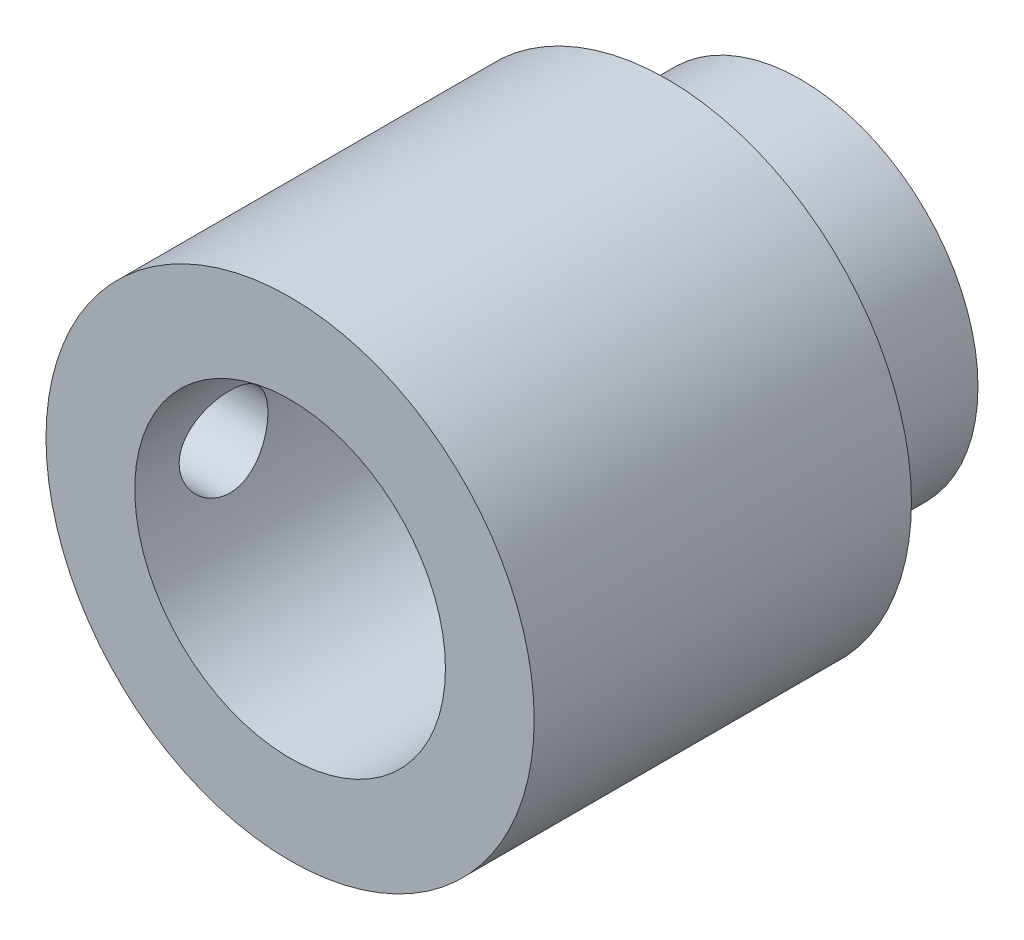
ISO-10303-21;
HEADER;
FILE_DESCRIPTION(('STEP AP214'),'2;1');
FILE_NAME('part.step','',(''),(''),'','','');
FILE_SCHEMA(('AUTOMOTIVE_DESIGN { 1 0 10303 214 1 1 1 1 }'));
ENDSEC;
DATA;
#1=APPLICATION_CONTEXT('core data for automotive mechanical design processes');
#2=APPLICATION_PROTOCOL_DEFINITION('international standard','automotive_design',2000,#1);
#3=PRODUCT_CONTEXT('',#1,'mechanical');
#4=PRODUCT('Part','Part','',(#3));
#5=PRODUCT_RELATED_PRODUCT_CATEGORY('part','',(#4));
#6=PRODUCT_DEFINITION_FORMATION('','',#4);
#7=PRODUCT_DEFINITION_CONTEXT('part definition',#1,'design');
#8=PRODUCT_DEFINITION('design','',#6,#7);
#9=PRODUCT_DEFINITION_SHAPE('','',#8);
#10=(LENGTH_UNIT() NAMED_UNIT(*) SI_UNIT(.MILLI.,.METRE.));
#11=(NAMED_UNIT(*) PLANE_ANGLE_UNIT() SI_UNIT($,.RADIAN.));
#12=(NAMED_UNIT(*) SI_UNIT($,.STERADIAN.) SOLID_ANGLE_UNIT());
#13=UNCERTAINTY_MEASURE_WITH_UNIT(LENGTH_MEASURE(1.E-05),#10,'distance_accuracy_value','');
#14=(GEOMETRIC_REPRESENTATION_CONTEXT(3) GLOBAL_UNCERTAINTY_ASSIGNED_CONTEXT((#13)) GLOBAL_UNIT_ASSIGNED_CONTEXT((#10,
#11,#12)) REPRESENTATION_CONTEXT('',''));
#15=CARTESIAN_POINT('',(0.,0.,0.));
#16=DIRECTION('',(0.,0.,1.));
#17=DIRECTION('',(1.,0.,0.));
#18=AXIS2_PLACEMENT_3D('',#15,#16,#17);
#19=CARTESIAN_POINT('',(0.,0.,0.));
#20=DIRECTION('',(0.,0.,1.));
#21=DIRECTION('',(1.,0.,0.));
#22=AXIS2_PLACEMENT_3D('',#19,#20,#21);
#23=PLANE('',#22);
#24=CARTESIAN_POINT('',(0.,0.,0.));
#25=DIRECTION('',(0.,0.,1.));
#26=DIRECTION('',(1.,0.,0.));
#27=AXIS2_PLACEMENT_3D('',#24,#25,#26);
#28=CIRCLE('',#27,5.5);
#29=CARTESIAN_POINT('',(5.5,0.,0.));
#30=VERTEX_POINT('',#29);
#31=EDGE_CURVE('E44',#30,#30,#28,.T.);
#32=ORIENTED_EDGE('',*,*,#31,.F.);
#33=EDGE_LOOP('',(#32));
#34=FACE_BOUND('',#33,.T.);
#35=CARTESIAN_POINT('',(0.,0.,0.));
#36=DIRECTION('',(0.,0.,1.));
#37=DIRECTION('',(1.,0.,0.));
#38=AXIS2_PLACEMENT_3D('',#35,#36,#37);
#39=CIRCLE('',#38,4.);
#40=CARTESIAN_POINT('',(4.,0.,0.));
#41=VERTEX_POINT('',#40);
#42=EDGE_CURVE('E10',#41,#41,#39,.F.);
#43=ORIENTED_EDGE('',*,*,#42,.F.);
#44=EDGE_LOOP('',(#43));
#45=FACE_BOUND('',#44,.T.);
#46=ADVANCED_FACE('F27',(#34,#45),#23,.F.);
#47=CARTESIAN_POINT('',(0.,0.,8.5));
#48=DIRECTION('',(0.,0.,-1.));
#49=DIRECTION('',(-1.,0.,0.));
#50=AXIS2_PLACEMENT_3D('',#47,#48,#49);
#51=CYLINDRICAL_SURFACE('',#50,5.5);
#52=CARTESIAN_POINT('',(-5.5,0.,5.5));
#53=CARTESIAN_POINT('',(-5.49999900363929,0.0556786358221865,5.50000215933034));
#54=CARTESIAN_POINT('',(-5.49914576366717,0.111385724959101,5.50466587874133));
#55=CARTESIAN_POINT('',(-5.49582423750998,0.221232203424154,5.52318673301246));
#56=CARTESIAN_POINT('',(-5.4933545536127,0.275370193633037,5.53705182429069));
#57=CARTESIAN_POINT('',(-5.48707661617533,0.380473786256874,5.57353856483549));
#58=CARTESIAN_POINT('',(-5.4832695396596,0.431442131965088,5.59615251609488));
#59=CARTESIAN_POINT('',(-5.47473335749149,0.528856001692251,5.64947366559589));
#60=CARTESIAN_POINT('',(-5.47000433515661,0.575301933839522,5.6801801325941));
#61=CARTESIAN_POINT('',(-5.46008716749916,0.662882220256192,5.74918295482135));
#62=CARTESIAN_POINT('',(-5.45489486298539,0.703958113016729,5.78755292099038));
#63=CARTESIAN_POINT('',(-5.44466747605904,0.779126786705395,5.87063517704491));
#64=CARTESIAN_POINT('',(-5.43963240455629,0.813219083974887,5.91534790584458));
#65=CARTESIAN_POINT('',(-5.43024920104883,0.873693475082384,6.01025636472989));
#66=CARTESIAN_POINT('',(-5.42590643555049,0.900016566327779,6.06049026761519));
#67=CARTESIAN_POINT('',(-5.41845791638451,0.943827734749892,6.16475932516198));
#68=CARTESIAN_POINT('',(-5.41535206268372,0.961316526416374,6.21879417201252));
#69=CARTESIAN_POINT('',(-5.41077076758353,0.986775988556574,6.3285073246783));
#70=CARTESIAN_POINT('',(-5.40927792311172,0.994848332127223,6.38416129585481));
#71=CARTESIAN_POINT('',(-5.40803915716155,1.00156124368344,6.49605220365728));
#72=CARTESIAN_POINT('',(-5.40829308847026,1.00020260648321,6.55228909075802));
#73=CARTESIAN_POINT('',(-5.4105033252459,0.988174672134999,6.66301595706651));
#74=CARTESIAN_POINT('',(-5.41243856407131,0.97762058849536,6.71751893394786));
#75=CARTESIAN_POINT('',(-5.41776030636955,0.947682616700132,6.82396750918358));
#76=CARTESIAN_POINT('',(-5.42114686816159,0.928298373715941,6.87591300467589));
#77=CARTESIAN_POINT('',(-5.42901190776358,0.881136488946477,6.97611139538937));
#78=CARTESIAN_POINT('',(-5.43349645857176,0.853311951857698,7.02434172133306));
#79=CARTESIAN_POINT('',(-5.44304811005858,0.790092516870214,7.11549236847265));
#80=CARTESIAN_POINT('',(-5.44811526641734,0.754696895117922,7.15841218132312));
#81=CARTESIAN_POINT('',(-5.45835320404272,0.676716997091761,7.23838949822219));
#82=CARTESIAN_POINT('',(-5.46352440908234,0.634034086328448,7.27535084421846));
#83=CARTESIAN_POINT('',(-5.47331875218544,0.543022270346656,7.34160256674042));
#84=CARTESIAN_POINT('',(-5.4779418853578,0.494693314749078,7.37089287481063));
#85=CARTESIAN_POINT('',(-5.4861276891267,0.393663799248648,7.42098369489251));
#86=CARTESIAN_POINT('',(-5.48968916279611,0.340958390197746,7.44177463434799));
#87=CARTESIAN_POINT('',(-5.49534102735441,0.232724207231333,7.47418159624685));
#88=CARTESIAN_POINT('',(-5.49743156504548,0.177195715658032,7.48579853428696));
#89=CARTESIAN_POINT('',(-5.49988596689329,0.0657193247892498,7.49939488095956));
#90=CARTESIAN_POINT('',(-5.50027344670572,0.00978800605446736,7.50150611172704));
#91=CARTESIAN_POINT('',(-5.4993431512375,-0.101628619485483,7.49638410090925));
#92=CARTESIAN_POINT('',(-5.49802545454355,-0.157113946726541,7.48915128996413));
#93=CARTESIAN_POINT('',(-5.49384754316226,-0.265648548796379,7.46565612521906));
#94=CARTESIAN_POINT('',(-5.49099865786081,-0.318712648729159,7.44946006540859));
#95=CARTESIAN_POINT('',(-5.48407647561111,-0.421372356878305,7.40856958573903));
#96=CARTESIAN_POINT('',(-5.48000309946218,-0.470967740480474,7.38387461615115));
#97=CARTESIAN_POINT('',(-5.4710248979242,-0.565847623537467,7.32639268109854));
#98=CARTESIAN_POINT('',(-5.466111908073,-0.61108222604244,7.29352465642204));
#99=CARTESIAN_POINT('',(-5.45602144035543,-0.695441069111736,7.22073981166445));
#100=CARTESIAN_POINT('',(-5.45084393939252,-0.734564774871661,7.18082237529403));
#101=CARTESIAN_POINT('',(-5.44073019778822,-0.806088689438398,7.09447655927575));
#102=CARTESIAN_POINT('',(-5.43579776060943,-0.838399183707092,7.04797334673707));
#103=CARTESIAN_POINT('',(-5.4268075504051,-0.894749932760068,6.95012190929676));
#104=CARTESIAN_POINT('',(-5.42274974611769,-0.918790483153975,6.89877385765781));
#105=CARTESIAN_POINT('',(-5.41599772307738,-0.957789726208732,6.79292462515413));
#106=CARTESIAN_POINT('',(-5.41329719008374,-0.972790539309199,6.73843938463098));
#107=CARTESIAN_POINT('',(-5.40955063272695,-0.993415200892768,6.62766850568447));
#108=CARTESIAN_POINT('',(-5.40850443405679,-0.999040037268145,6.57138305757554));
#109=CARTESIAN_POINT('',(-5.40819346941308,-1.00072156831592,6.45950731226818));
#110=CARTESIAN_POINT('',(-5.40890237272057,-0.996919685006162,6.40391916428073));
#111=CARTESIAN_POINT('',(-5.41196354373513,-0.980164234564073,6.29418818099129));
#112=CARTESIAN_POINT('',(-5.41431580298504,-0.967210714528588,6.24004533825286));
#113=CARTESIAN_POINT('',(-5.42038786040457,-0.932577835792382,6.13481190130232));
#114=CARTESIAN_POINT('',(-5.42410539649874,-0.91091290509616,6.08371641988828));
#115=CARTESIAN_POINT('',(-5.43249088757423,-0.859487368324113,5.98586277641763));
#116=CARTESIAN_POINT('',(-5.4371589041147,-0.829726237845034,5.93910489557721));
#117=CARTESIAN_POINT('',(-5.44700162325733,-0.762457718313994,5.85054356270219));
#118=CARTESIAN_POINT('',(-5.45218253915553,-0.724847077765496,5.80881921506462));
#119=CARTESIAN_POINT('',(-5.46241996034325,-0.643163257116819,5.7322264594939));
#120=CARTESIAN_POINT('',(-5.46747643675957,-0.599088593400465,5.69735962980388));
#121=CARTESIAN_POINT('',(-5.47694487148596,-0.505285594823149,5.63519985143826));
#122=CARTESIAN_POINT('',(-5.48135106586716,-0.455512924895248,5.60797290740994));
#123=CARTESIAN_POINT('',(-5.48896630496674,-0.352036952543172,5.56231039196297));
#124=CARTESIAN_POINT('',(-5.49217649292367,-0.298337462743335,5.54386642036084));
#125=CARTESIAN_POINT('',(-5.49637035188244,-0.203720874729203,5.52011228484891));
#126=CARTESIAN_POINT('',(-5.49772390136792,-0.163362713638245,5.51258283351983));
#127=CARTESIAN_POINT('',(-5.49953908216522,-0.0820081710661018,5.50252595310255));
#128=CARTESIAN_POINT('',(-5.50000073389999,-0.0410118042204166,5.49999840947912));
#129=CARTESIAN_POINT('',(-5.5,0.,5.5));
#130=B_SPLINE_CURVE_WITH_KNOTS('',3,(#52,#53,#54,#55,#56,#57,#58,#59,#60,#61,#62,#63,#64,#65,
#66,#67,#68,#69,#70,#71,#72,#73,#74,#75,#76,#77,#78,#79,#80,#81,#82,#83,#84,#85,#86,#87,#88,#89,
#90,#91,#92,#93,#94,#95,#96,#97,#98,#99,#100,#101,#102,#103,#104,#105,#106,#107,#108,#109,#110,
#111,#112,#113,#114,#115,#116,#117,#118,#119,#120,#121,#122,#123,#124,#125,#126,#127,#128,#129),
.UNSPECIFIED.,.T.,.F.,(4,2,2,2,2,2,2,2,2,2,2,2,2,2,2,2,2,2,2,2,2,2,2,2,2,2,2,2,2,2,2,2,2,2,2,2,
2,2,4),(0.,0.166885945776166,0.333916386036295,0.500800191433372,0.667668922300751,
0.836225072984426,1.00479289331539,1.17460976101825,1.34441289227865,1.51236510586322,
1.68030316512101,1.84616683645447,2.01203717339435,2.17884653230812,2.34567184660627,
2.51496605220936,2.68426176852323,2.85374763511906,3.02321658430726,3.19032800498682,
3.35743172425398,3.52331571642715,3.6892104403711,3.85682113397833,4.02444648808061,
4.19415753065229,4.36386250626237,4.53277050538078,4.70166070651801,4.86803254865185,
5.03440353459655,5.20050010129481,5.36660742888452,5.53505557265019,5.70354243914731,
5.87344302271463,6.04318078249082,6.16610855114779,6.28903350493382),.UNSPECIFIED.);
#131=CARTESIAN_POINT('',(-5.5,0.,5.5));
#132=VERTEX_POINT('',#131);
#133=EDGE_CURVE('E70',#132,#132,#130,.T.);
#134=ORIENTED_EDGE('',*,*,#133,.T.);
#135=EDGE_LOOP('',(#134));
#136=FACE_BOUND('',#135,.T.);
#137=CARTESIAN_POINT('',(0.,0.,8.5));
#138=DIRECTION('',(0.,0.,1.));
#139=DIRECTION('',(1.,0.,0.));
#140=AXIS2_PLACEMENT_3D('',#137,#138,#139);
#141=CIRCLE('',#140,5.5);
#142=CARTESIAN_POINT('',(5.5,0.,8.5));
#143=VERTEX_POINT('',#142);
#144=EDGE_CURVE('E40',#143,#143,#141,.T.);
#145=ORIENTED_EDGE('',*,*,#144,.F.);
#146=EDGE_LOOP('',(#145));
#147=FACE_BOUND('',#146,.T.);
#148=ORIENTED_EDGE('',*,*,#31,.T.);
#149=EDGE_LOOP('',(#148));
#150=FACE_BOUND('',#149,.T.);
#151=ADVANCED_FACE('F29',(#136,#147,#150),#51,.T.);
#152=CARTESIAN_POINT('',(0.,0.,8.5));
#153=DIRECTION('',(0.,0.,1.));
#154=DIRECTION('',(1.,0.,0.));
#155=AXIS2_PLACEMENT_3D('',#152,#153,#154);
#156=PLANE('',#155);
#157=CARTESIAN_POINT('',(0.,0.,8.5));
#158=DIRECTION('',(0.,0.,1.));
#159=DIRECTION('',(1.,0.,0.));
#160=AXIS2_PLACEMENT_3D('',#157,#158,#159);
#161=CIRCLE('',#160,3.5);
#162=CARTESIAN_POINT('',(3.5,0.,8.5));
#163=VERTEX_POINT('',#162);
#164=EDGE_CURVE('E49',#163,#163,#161,.T.);
#165=ORIENTED_EDGE('',*,*,#164,.F.);
#166=EDGE_LOOP('',(#165));
#167=FACE_BOUND('',#166,.T.);
#168=ORIENTED_EDGE('',*,*,#144,.T.);
#169=EDGE_LOOP('',(#168));
#170=FACE_BOUND('',#169,.T.);
#171=ADVANCED_FACE('F107',(#167,#170),#156,.T.);
#172=CARTESIAN_POINT('',(0.,0.,8.5));
#173=DIRECTION('',(0.,0.,1.));
#174=DIRECTION('',(1.,0.,0.));
#175=AXIS2_PLACEMENT_3D('',#172,#173,#174);
#176=CYLINDRICAL_SURFACE('',#175,3.5);
#177=CARTESIAN_POINT('',(-3.5,0.,5.5));
#178=CARTESIAN_POINT('',(-3.49999934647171,-0.0549774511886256,5.50000096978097));
#179=CARTESIAN_POINT('',(-3.49869208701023,-0.109964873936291,5.50454889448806));
#180=CARTESIAN_POINT('',(-3.49360452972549,-0.218345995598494,5.52258213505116));
#181=CARTESIAN_POINT('',(-3.48982329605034,-0.271739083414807,5.53607083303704));
#182=CARTESIAN_POINT('',(-3.48020345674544,-0.375352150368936,5.57150401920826));
#183=CARTESIAN_POINT('',(-3.474367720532,-0.425576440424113,5.59343671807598));
#184=CARTESIAN_POINT('',(-3.46124989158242,-0.521634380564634,5.64508899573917));
#185=CARTESIAN_POINT('',(-3.45396764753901,-0.567467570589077,5.67480938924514));
#186=CARTESIAN_POINT('',(-3.43852367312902,-0.654647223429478,5.7420175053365));
#187=CARTESIAN_POINT('',(-3.4303452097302,-0.69586186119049,5.77967237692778));
#188=CARTESIAN_POINT('',(-3.41413367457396,-0.771485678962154,5.8613238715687));
#189=CARTESIAN_POINT('',(-3.40610062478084,-0.805893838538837,5.90532144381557));
#190=CARTESIAN_POINT('',(-3.39091507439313,-0.867598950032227,5.99949679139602));
#191=CARTESIAN_POINT('',(-3.38378351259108,-0.894739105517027,6.04978099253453));
#192=CARTESIAN_POINT('',(-3.37145671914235,-0.940125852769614,6.15443600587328));
#193=CARTESIAN_POINT('',(-3.36626107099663,-0.958374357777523,6.2088059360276));
#194=CARTESIAN_POINT('',(-3.35856804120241,-0.984992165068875,6.31861738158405));
#195=CARTESIAN_POINT('',(-3.35600489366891,-0.993602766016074,6.37399568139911));
#196=CARTESIAN_POINT('',(-3.35367104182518,-1.00145333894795,6.48546557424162));
#197=CARTESIAN_POINT('',(-3.35389973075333,-1.00069534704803,6.54155700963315));
#198=CARTESIAN_POINT('',(-3.35706517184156,-0.990020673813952,6.6509343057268));
#199=CARTESIAN_POINT('',(-3.35991391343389,-0.980401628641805,6.70425217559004));
#200=CARTESIAN_POINT('',(-3.36785674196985,-0.952756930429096,6.80848360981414));
#201=CARTESIAN_POINT('',(-3.37295103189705,-0.934730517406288,6.85939695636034));
#202=CARTESIAN_POINT('',(-3.38488431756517,-0.890553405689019,6.95812312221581));
#203=CARTESIAN_POINT('',(-3.39174458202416,-0.864302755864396,7.00588853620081));
#204=CARTESIAN_POINT('',(-3.40642608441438,-0.804491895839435,7.09643828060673));
#205=CARTESIAN_POINT('',(-3.41424753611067,-0.770930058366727,7.13922149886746));
#206=CARTESIAN_POINT('',(-3.43033125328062,-0.695951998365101,7.22028618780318));
#207=CARTESIAN_POINT('',(-3.43859902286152,-0.654287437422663,7.25833723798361));
#208=CARTESIAN_POINT('',(-3.45438123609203,-0.565066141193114,7.32696300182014));
#209=CARTESIAN_POINT('',(-3.46189564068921,-0.517509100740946,7.35753732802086));
#210=CARTESIAN_POINT('',(-3.47538264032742,-0.417461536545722,7.41046436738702));
#211=CARTESIAN_POINT('',(-3.48134637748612,-0.364944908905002,7.43277014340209));
#212=CARTESIAN_POINT('',(-3.49099625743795,-0.256696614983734,7.46816694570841));
#213=CARTESIAN_POINT('',(-3.49468297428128,-0.200965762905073,7.48126029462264));
#214=CARTESIAN_POINT('',(-3.49927437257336,-0.0898331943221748,7.49748664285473));
#215=CARTESIAN_POINT('',(-3.50026636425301,-0.0344806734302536,7.50093234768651));
#216=CARTESIAN_POINT('',(-3.49961042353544,0.0760132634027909,7.49863636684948));
#217=CARTESIAN_POINT('',(-3.49796280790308,0.131154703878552,7.49289578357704));
#218=CARTESIAN_POINT('',(-3.49226963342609,0.238509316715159,7.47264477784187));
#219=CARTESIAN_POINT('',(-3.48827306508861,0.290759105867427,7.45831340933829));
#220=CARTESIAN_POINT('',(-3.47833999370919,0.392104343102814,7.42149974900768));
#221=CARTESIAN_POINT('',(-3.47240326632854,0.441199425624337,7.39901651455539));
#222=CARTESIAN_POINT('',(-3.45904980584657,0.536020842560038,7.34598833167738));
#223=CARTESIAN_POINT('',(-3.45160381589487,0.581651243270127,7.31527940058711));
#224=CARTESIAN_POINT('',(-3.43608973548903,0.667219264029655,7.24687374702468));
#225=CARTESIAN_POINT('',(-3.42802150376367,0.707155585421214,7.20917543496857));
#226=CARTESIAN_POINT('',(-3.41184309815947,0.781553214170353,7.1263953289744));
#227=CARTESIAN_POINT('',(-3.40374018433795,0.81579271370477,7.08111236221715));
#228=CARTESIAN_POINT('',(-3.38869447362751,0.87619765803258,6.98526870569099));
#229=CARTESIAN_POINT('',(-3.3817516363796,0.902363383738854,6.93470819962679));
#230=CARTESIAN_POINT('',(-3.36989325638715,0.945687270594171,6.82995439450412));
#231=CARTESIAN_POINT('',(-3.36496700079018,0.962893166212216,6.77578211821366));
#232=CARTESIAN_POINT('',(-3.35771228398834,0.987897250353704,6.66514503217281));
#233=CARTESIAN_POINT('',(-3.35538303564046,0.995698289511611,6.608680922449));
#234=CARTESIAN_POINT('',(-3.35365851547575,1.00149012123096,6.49735198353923));
#235=CARTESIAN_POINT('',(-3.35415580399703,0.999840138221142,6.44250724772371));
#236=CARTESIAN_POINT('',(-3.35777298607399,0.987623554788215,6.33391263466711));
#237=CARTESIAN_POINT('',(-3.36089279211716,0.977057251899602,6.2801627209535));
#238=CARTESIAN_POINT('',(-3.36933488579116,0.947529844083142,6.17581081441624));
#239=CARTESIAN_POINT('',(-3.37463438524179,0.928655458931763,6.12518230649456));
#240=CARTESIAN_POINT('',(-3.38683651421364,0.883114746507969,6.02777063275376));
#241=CARTESIAN_POINT('',(-3.39373942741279,0.856447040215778,5.98098814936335));
#242=CARTESIAN_POINT('',(-3.40865834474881,0.795032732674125,5.89090823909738));
#243=CARTESIAN_POINT('',(-3.41670381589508,0.760046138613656,5.84777930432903));
#244=CARTESIAN_POINT('',(-3.43284922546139,0.683429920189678,5.76788805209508));
#245=CARTESIAN_POINT('',(-3.4409491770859,0.64179862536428,5.7311273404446));
#246=CARTESIAN_POINT('',(-3.45653979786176,0.551787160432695,5.66408140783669));
#247=CARTESIAN_POINT('',(-3.46400950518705,0.50326125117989,5.63398650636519));
#248=CARTESIAN_POINT('',(-3.47725697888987,0.401625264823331,5.582427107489));
#249=CARTESIAN_POINT('',(-3.48303566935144,0.34851771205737,5.56095789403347));
#250=CARTESIAN_POINT('',(-3.49163672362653,0.246458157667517,5.52957622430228));
#251=CARTESIAN_POINT('',(-3.49474842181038,0.197881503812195,5.51851323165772));
#252=CARTESIAN_POINT('',(-3.49893021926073,0.0995391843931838,5.50372517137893));
#253=CARTESIAN_POINT('',(-3.50000059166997,0.049773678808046,5.49999912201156));
#254=CARTESIAN_POINT('',(-3.5,0.,5.5));
#255=B_SPLINE_CURVE_WITH_KNOTS('',3,(#177,#178,#179,#180,#181,#182,#183,#184,#185,#186,#187,
#188,#189,#190,#191,#192,#193,#194,#195,#196,#197,#198,#199,#200,#201,#202,#203,#204,#205,#206,
#207,#208,#209,#210,#211,#212,#213,#214,#215,#216,#217,#218,#219,#220,#221,#222,#223,#224,#225,
#226,#227,#228,#229,#230,#231,#232,#233,#234,#235,#236,#237,#238,#239,#240,#241,#242,#243,#244,
#245,#246,#247,#248,#249,#250,#251,#252,#253,#254),.UNSPECIFIED.,.T.,.F.,(4,2,2,2,2,2,2,2,2,2,2,
2,2,2,2,2,2,2,2,2,2,2,2,2,2,2,2,2,2,2,2,2,2,2,2,2,2,2,4),(0.,0.164749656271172,0.32956166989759,
0.494144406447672,0.658744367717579,0.827239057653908,0.995758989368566,1.16766537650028,
1.33953475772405,1.50699754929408,1.67442394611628,1.83642392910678,1.99843855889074,
2.16250401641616,2.32660602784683,2.49689250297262,2.66718780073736,2.83843550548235,
3.00964002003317,3.17522728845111,3.34079468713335,3.50302570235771,3.66527548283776,
3.83103762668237,3.99683751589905,4.16806052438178,4.3392775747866,4.50957286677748,
4.6798165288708,4.84363340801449,5.00744482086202,5.16958548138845,5.33175484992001,
5.49933828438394,5.66696391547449,5.83888989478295,6.01072174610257,6.15989734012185,
6.30905297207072),.UNSPECIFIED.);
#256=CARTESIAN_POINT('',(-3.5,0.,5.5));
#257=VERTEX_POINT('',#256);
#258=EDGE_CURVE('E32',#257,#257,#255,.T.);
#259=ORIENTED_EDGE('',*,*,#258,.T.);
#260=EDGE_LOOP('',(#259));
#261=FACE_BOUND('',#260,.T.);
#262=CARTESIAN_POINT('',(0.,0.,0.5));
#263=DIRECTION('',(0.,0.,1.));
#264=DIRECTION('',(1.,0.,0.));
#265=AXIS2_PLACEMENT_3D('',#262,#263,#264);
#266=CIRCLE('',#265,3.5);
#267=CARTESIAN_POINT('',(3.5,0.,0.5));
#268=VERTEX_POINT('',#267);
#269=EDGE_CURVE('E52',#268,#268,#266,.T.);
#270=ORIENTED_EDGE('',*,*,#269,.F.);
#271=EDGE_LOOP('',(#270));
#272=FACE_BOUND('',#271,.T.);
#273=ORIENTED_EDGE('',*,*,#164,.T.);
#274=EDGE_LOOP('',(#273));
#275=FACE_BOUND('',#274,.T.);
#276=ADVANCED_FACE('F102',(#261,#272,#275),#176,.F.);
#277=CARTESIAN_POINT('',(0.,0.,0.5));
#278=DIRECTION('',(0.,0.,-1.));
#279=DIRECTION('',(-1.,0.,0.));
#280=AXIS2_PLACEMENT_3D('',#277,#278,#279);
#281=PLANE('',#280);
#282=CARTESIAN_POINT('',(0.,0.,0.5));
#283=DIRECTION('',(0.,0.,-1.));
#284=DIRECTION('',(-1.,0.,0.));
#285=AXIS2_PLACEMENT_3D('',#282,#283,#284);
#286=CIRCLE('',#285,2.);
#287=CARTESIAN_POINT('',(-2.,0.,0.5));
#288=VERTEX_POINT('',#287);
#289=EDGE_CURVE('E64',#288,#288,#286,.T.);
#290=ORIENTED_EDGE('',*,*,#289,.T.);
#291=EDGE_LOOP('',(#290));
#292=FACE_BOUND('',#291,.T.);
#293=ORIENTED_EDGE('',*,*,#269,.T.);
#294=EDGE_LOOP('',(#293));
#295=FACE_BOUND('',#294,.T.);
#296=ADVANCED_FACE('F99',(#292,#295),#281,.F.);
#297=CARTESIAN_POINT('',(0.,0.,-3.));
#298=DIRECTION('',(0.,0.,1.));
#299=DIRECTION('',(1.,0.,0.));
#300=AXIS2_PLACEMENT_3D('',#297,#298,#299);
#301=CYLINDRICAL_SURFACE('',#300,4.);
#302=CARTESIAN_POINT('',(0.,0.,-3.));
#303=DIRECTION('',(0.,0.,-1.));
#304=DIRECTION('',(-1.,0.,0.));
#305=AXIS2_PLACEMENT_3D('',#302,#303,#304);
#306=CIRCLE('',#305,4.);
#307=CARTESIAN_POINT('',(-4.,0.,-3.));
#308=VERTEX_POINT('',#307);
#309=EDGE_CURVE('E55',#308,#308,#306,.T.);
#310=ORIENTED_EDGE('',*,*,#309,.F.);
#311=EDGE_LOOP('',(#310));
#312=FACE_BOUND('',#311,.T.);
#313=ORIENTED_EDGE('',*,*,#42,.T.);
#314=EDGE_LOOP('',(#313));
#315=FACE_BOUND('',#314,.T.);
#316=ADVANCED_FACE('F95',(#312,#315),#301,.T.);
#317=CARTESIAN_POINT('',(0.,0.,-3.));
#318=DIRECTION('',(0.,0.,-1.));
#319=DIRECTION('',(-1.,0.,0.));
#320=AXIS2_PLACEMENT_3D('',#317,#318,#319);
#321=PLANE('',#320);
#322=CARTESIAN_POINT('',(0.,0.,-3.));
#323=DIRECTION('',(0.,0.,-1.));
#324=DIRECTION('',(-1.,0.,0.));
#325=AXIS2_PLACEMENT_3D('',#322,#323,#324);
#326=CIRCLE('',#325,2.75);
#327=CARTESIAN_POINT('',(-2.75,0.,-3.));
#328=VERTEX_POINT('',#327);
#329=EDGE_CURVE('E61',#328,#328,#326,.T.);
#330=ORIENTED_EDGE('',*,*,#329,.F.);
#331=EDGE_LOOP('',(#330));
#332=FACE_BOUND('',#331,.T.);
#333=ORIENTED_EDGE('',*,*,#309,.T.);
#334=EDGE_LOOP('',(#333));
#335=FACE_BOUND('',#334,.T.);
#336=ADVANCED_FACE('F91',(#332,#335),#321,.T.);
#337=CARTESIAN_POINT('',(0.,0.,-2.1));
#338=DIRECTION('',(0.,0.,-1.));
#339=DIRECTION('',(-1.,0.,0.));
#340=AXIS2_PLACEMENT_3D('',#337,#338,#339);
#341=CYLINDRICAL_SURFACE('',#340,2.75);
#342=CARTESIAN_POINT('',(0.,0.,-2.1));
#343=DIRECTION('',(0.,0.,-1.));
#344=DIRECTION('',(-1.,0.,0.));
#345=AXIS2_PLACEMENT_3D('',#342,#343,#344);
#346=CIRCLE('',#345,2.75);
#347=CARTESIAN_POINT('',(-2.75,0.,-2.1));
#348=VERTEX_POINT('',#347);
#349=EDGE_CURVE('E58',#348,#348,#346,.T.);
#350=ORIENTED_EDGE('',*,*,#349,.F.);
#351=EDGE_LOOP('',(#350));
#352=FACE_BOUND('',#351,.T.);
#353=ORIENTED_EDGE('',*,*,#329,.T.);
#354=EDGE_LOOP('',(#353));
#355=FACE_BOUND('',#354,.T.);
#356=ADVANCED_FACE('F87',(#352,#355),#341,.F.);
#357=CARTESIAN_POINT('',(0.,0.,-2.1));
#358=DIRECTION('',(0.,0.,-1.));
#359=DIRECTION('',(-1.,0.,0.));
#360=AXIS2_PLACEMENT_3D('',#357,#358,#359);
#361=PLANE('',#360);
#362=CARTESIAN_POINT('',(0.,0.,-2.1));
#363=DIRECTION('',(0.,0.,-1.));
#364=DIRECTION('',(-1.,0.,0.));
#365=AXIS2_PLACEMENT_3D('',#362,#363,#364);
#366=CIRCLE('',#365,2.);
#367=CARTESIAN_POINT('',(-2.,0.,-2.1));
#368=VERTEX_POINT('',#367);
#369=EDGE_CURVE('E67',#368,#368,#366,.T.);
#370=ORIENTED_EDGE('',*,*,#369,.F.);
#371=EDGE_LOOP('',(#370));
#372=FACE_BOUND('',#371,.T.);
#373=ORIENTED_EDGE('',*,*,#349,.T.);
#374=EDGE_LOOP('',(#373));
#375=FACE_BOUND('',#374,.T.);
#376=ADVANCED_FACE('F83',(#372,#375),#361,.T.);
#377=CARTESIAN_POINT('',(0.,0.,8.5));
#378=DIRECTION('',(0.,0.,-1.));
#379=DIRECTION('',(-1.,0.,0.));
#380=AXIS2_PLACEMENT_3D('',#377,#378,#379);
#381=CYLINDRICAL_SURFACE('',#380,2.);
#382=ORIENTED_EDGE('',*,*,#369,.T.);
#383=EDGE_LOOP('',(#382));
#384=FACE_BOUND('',#383,.T.);
#385=ORIENTED_EDGE('',*,*,#289,.F.);
#386=EDGE_LOOP('',(#385));
#387=FACE_BOUND('',#386,.T.);
#388=ADVANCED_FACE('F78',(#384,#387),#381,.F.);
#389=CARTESIAN_POINT('',(-5.5,0.,6.5));
#390=DIRECTION('',(1.,0.,0.));
#391=DIRECTION('',(0.,0.,-1.));
#392=AXIS2_PLACEMENT_3D('',#389,#390,#391);
#393=CYLINDRICAL_SURFACE('',#392,1.);
#394=ORIENTED_EDGE('',*,*,#258,.F.);
#395=EDGE_LOOP('',(#394));
#396=FACE_BOUND('',#395,.T.);
#397=ORIENTED_EDGE('',*,*,#133,.F.);
#398=EDGE_LOOP('',(#397));
#399=FACE_BOUND('',#398,.T.);
#400=ADVANCED_FACE('F74',(#396,#399),#393,.F.);
#401=CLOSED_SHELL('',(#46,#151,#171,#276,#296,#316,#336,#356,#376,#388,#400));
#402=MANIFOLD_SOLID_BREP('B2',#401);
#403=ADVANCED_BREP_SHAPE_REPRESENTATION('',(#18,#402),#14);
#404=SHAPE_DEFINITION_REPRESENTATION(#9,#403);
ENDSEC;
END-ISO-10303-21;
